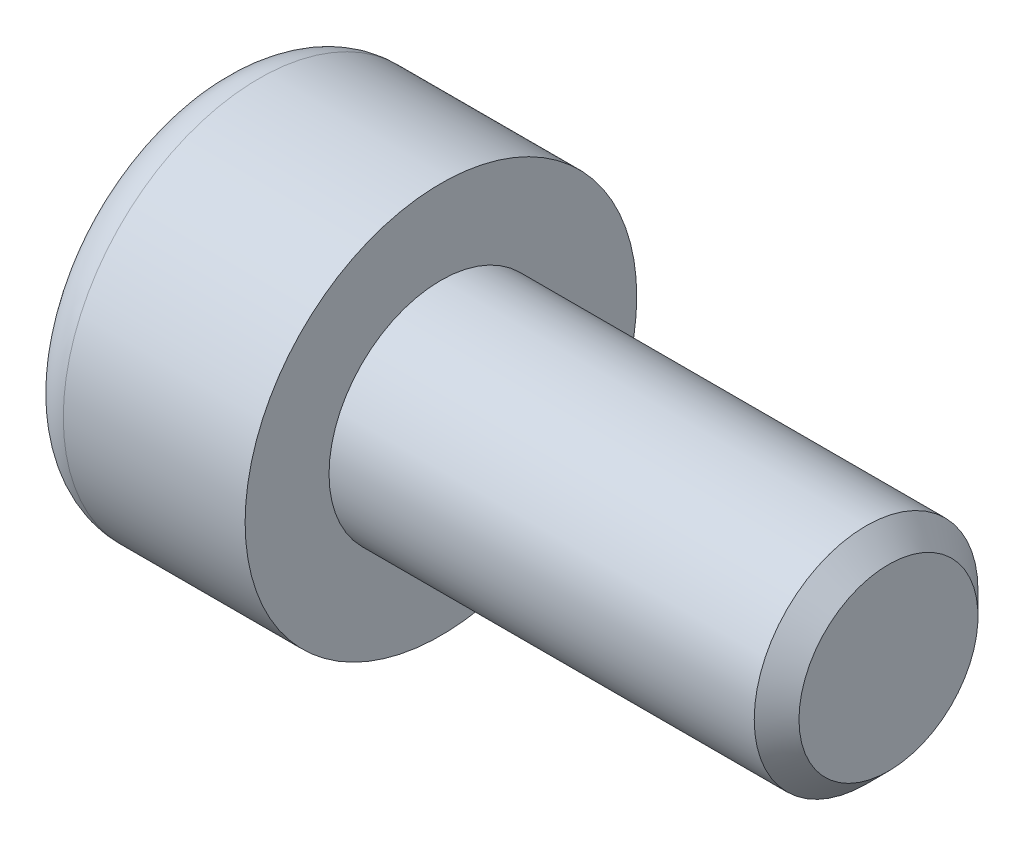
from build123d import *

# Parameters (mm, degrees)
CHANFREIN1_SIZE         = 0.4
CONG_1_R                = 0.75
ENL_V_MAT_EXTRU_1_DEPTH = 2.5


with BuildPart() as part:
    # Esquisse1 → Base-R_volution (revolve)
    with BuildSketch(Plane.XY, mode=Mode.PRIVATE) as base_r_volution_sk:
        Polygon((-4, 0), (-4, 3.5), (0, 3.5), (0, 2), (8, 2), (8, 0), align=None)
    revolve(base_r_volution_sk.sketch.rotate(Axis((-28.982684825, 0, 0), (1, 0, 0)), 90), axis=Axis((-28.982684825, 0, 0), (1, 0, 0)))

    # Chanfrein1
    chanfrein1_edges = [part.edges().sort_by_distance(p)[0] for p in [
        (8, 0, -2),
    ]]
    chamfer(chanfrein1_edges, length=CHANFREIN1_SIZE)

    # Cong_1
    cong_1_edges = [part.edges().sort_by_distance(p)[0] for p in [
        (-4, 0, -3.5),
    ]]
    fillet(cong_1_edges, radius=CONG_1_R)

    # Esquisse2 → Enl_v. mat.-Extru.1 (cut)
    with BuildSketch(Plane.ZY.offset(4)):
        Polygon((0.866025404, -1.5), (-0.866025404, -1.5), (-1.732050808, 0), (-0.866025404, 1.5), (0.866025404, 1.5), (1.732050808, 0), align=None)
    extrude(amount=-ENL_V_MAT_EXTRU_1_DEPTH, mode=Mode.SUBTRACT)


solid = part.part
